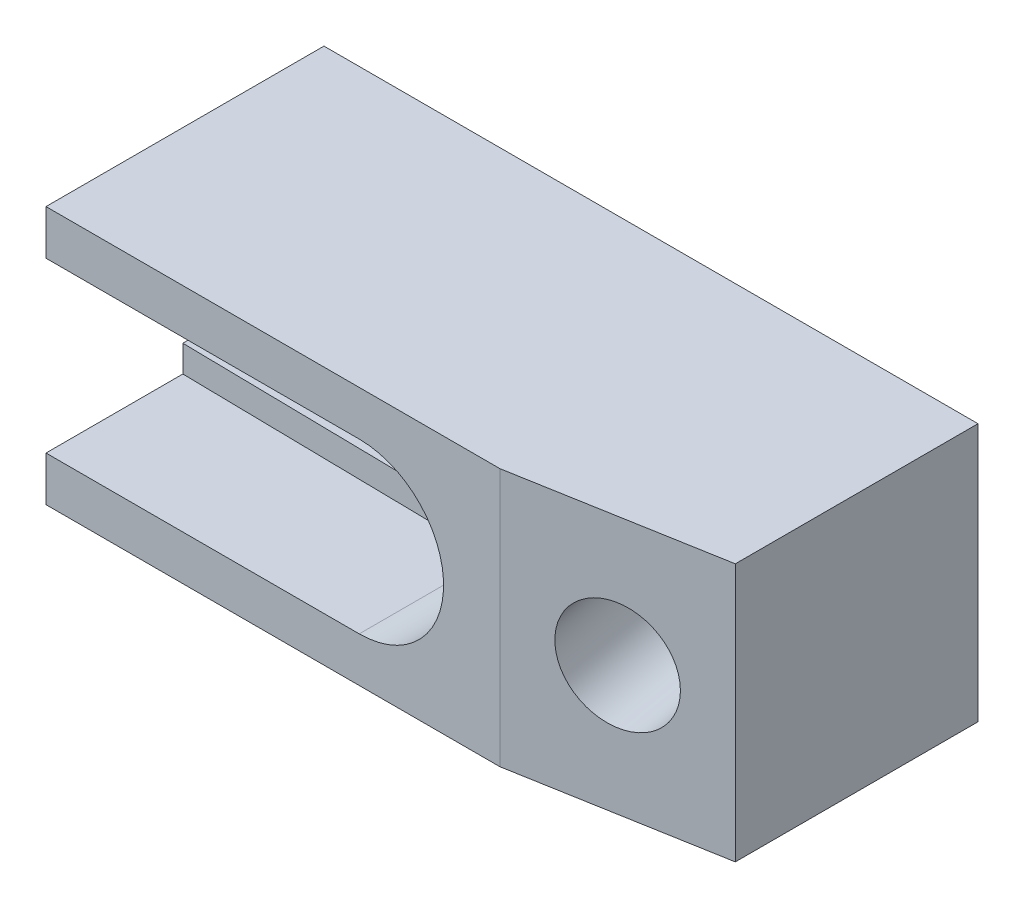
ISO-10303-21;
HEADER;
FILE_DESCRIPTION(('STEP AP214'),'2;1');
FILE_NAME('part.step','',(''),(''),'','','');
FILE_SCHEMA(('AUTOMOTIVE_DESIGN { 1 0 10303 214 1 1 1 1 }'));
ENDSEC;
DATA;
#1=APPLICATION_CONTEXT('core data for automotive mechanical design processes');
#2=APPLICATION_PROTOCOL_DEFINITION('international standard','automotive_design',2000,#1);
#3=PRODUCT_CONTEXT('',#1,'mechanical');
#4=PRODUCT('Part','Part','',(#3));
#5=PRODUCT_RELATED_PRODUCT_CATEGORY('part','',(#4));
#6=PRODUCT_DEFINITION_FORMATION('','',#4);
#7=PRODUCT_DEFINITION_CONTEXT('part definition',#1,'design');
#8=PRODUCT_DEFINITION('design','',#6,#7);
#9=PRODUCT_DEFINITION_SHAPE('','',#8);
#10=(LENGTH_UNIT() NAMED_UNIT(*) SI_UNIT(.MILLI.,.METRE.));
#11=(NAMED_UNIT(*) PLANE_ANGLE_UNIT() SI_UNIT($,.RADIAN.));
#12=(NAMED_UNIT(*) SI_UNIT($,.STERADIAN.) SOLID_ANGLE_UNIT());
#13=UNCERTAINTY_MEASURE_WITH_UNIT(LENGTH_MEASURE(1.E-05),#10,'distance_accuracy_value','');
#14=(GEOMETRIC_REPRESENTATION_CONTEXT(3) GLOBAL_UNCERTAINTY_ASSIGNED_CONTEXT((#13)) GLOBAL_UNIT_ASSIGNED_CONTEXT((#10,
#11,#12)) REPRESENTATION_CONTEXT('',''));
#15=CARTESIAN_POINT('',(0.,0.,0.));
#16=DIRECTION('',(0.,0.,1.));
#17=DIRECTION('',(1.,0.,0.));
#18=AXIS2_PLACEMENT_3D('',#15,#16,#17);
#19=CARTESIAN_POINT('',(50.292,19.05,0.));
#20=DIRECTION('',(0.,0.,1.));
#21=DIRECTION('',(1.,0.,0.));
#22=AXIS2_PLACEMENT_3D('',#19,#20,#21);
#23=PLANE('',#22);
#24=CARTESIAN_POINT('',(28.7527760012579,0.,0.));
#25=DIRECTION('',(0.,0.,1.));
#26=DIRECTION('',(1.,0.,0.));
#27=AXIS2_PLACEMENT_3D('',#24,#25,#26);
#28=ELLIPSE('',#27,8.12341289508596,8.);
#29=CARTESIAN_POINT('',(36.8761888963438,0.,0.));
#30=VERTEX_POINT('',#29);
#31=EDGE_CURVE('E129',#30,#30,#28,.T.);
#32=ORIENTED_EDGE('',*,*,#31,.T.);
#33=EDGE_LOOP('',(#32));
#34=FACE_BOUND('',#33,.T.);
#35=DIRECTION('',(1.,0.,0.));
#36=VECTOR('',#35,1.);
#37=CARTESIAN_POINT('',(50.292,8.509,0.));
#38=LINE('',#37,#36);
#39=CARTESIAN_POINT('',(-46.228,8.509,0.));
#40=VERTEX_POINT('',#39);
#41=CARTESIAN_POINT('',(0.,8.509,0.));
#42=VERTEX_POINT('',#41);
#43=EDGE_CURVE('E124',#40,#42,#38,.T.);
#44=ORIENTED_EDGE('',*,*,#43,.F.);
#45=DIRECTION('',(0.,-1.,0.));
#46=VECTOR('',#45,1.);
#47=CARTESIAN_POINT('',(-46.228,19.05,0.));
#48=LINE('',#47,#46);
#49=CARTESIAN_POINT('',(-46.228,19.05,0.));
#50=VERTEX_POINT('',#49);
#51=EDGE_CURVE('E192',#50,#40,#48,.T.);
#52=ORIENTED_EDGE('',*,*,#51,.F.);
#53=DIRECTION('',(-1.,0.,0.));
#54=VECTOR('',#53,1.);
#55=CARTESIAN_POINT('',(50.292,19.05,0.));
#56=LINE('',#55,#54);
#57=CARTESIAN_POINT('',(50.292,19.05,0.));
#58=VERTEX_POINT('',#57);
#59=EDGE_CURVE('E173',#58,#50,#56,.T.);
#60=ORIENTED_EDGE('',*,*,#59,.F.);
#61=DIRECTION('',(0.,-1.,0.));
#62=VECTOR('',#61,1.);
#63=CARTESIAN_POINT('',(50.292,19.05,0.));
#64=LINE('',#63,#62);
#65=CARTESIAN_POINT('',(50.292,-19.05,0.));
#66=VERTEX_POINT('',#65);
#67=EDGE_CURVE('E194',#58,#66,#64,.T.);
#68=ORIENTED_EDGE('',*,*,#67,.T.);
#69=DIRECTION('',(-1.,0.,0.));
#70=VECTOR('',#69,1.);
#71=CARTESIAN_POINT('',(50.292,-19.05,0.));
#72=LINE('',#71,#70);
#73=CARTESIAN_POINT('',(-46.228,-19.05,0.));
#74=VERTEX_POINT('',#73);
#75=EDGE_CURVE('E162',#66,#74,#72,.T.);
#76=ORIENTED_EDGE('',*,*,#75,.T.);
#77=CARTESIAN_POINT('',(-46.228,-8.509,0.));
#78=VERTEX_POINT('',#77);
#79=EDGE_CURVE('E133',#78,#74,#48,.T.);
#80=ORIENTED_EDGE('',*,*,#79,.F.);
#81=DIRECTION('',(-1.,0.,0.));
#82=VECTOR('',#81,1.);
#83=CARTESIAN_POINT('',(50.292,-8.509,0.));
#84=LINE('',#83,#82);
#85=CARTESIAN_POINT('',(0.,-8.509,0.));
#86=VERTEX_POINT('',#85);
#87=EDGE_CURVE('E125',#86,#78,#84,.T.);
#88=ORIENTED_EDGE('',*,*,#87,.F.);
#89=CARTESIAN_POINT('',(0.,0.,0.));
#90=DIRECTION('',(0.,0.,1.));
#91=DIRECTION('',(1.,0.,0.));
#92=AXIS2_PLACEMENT_3D('',#89,#90,#91);
#93=CIRCLE('',#92,8.509);
#94=EDGE_CURVE('E114',#42,#86,#93,.F.);
#95=ORIENTED_EDGE('',*,*,#94,.F.);
#96=EDGE_LOOP('',(#44,#52,#60,#68,#76,#80,#88,#95));
#97=FACE_BOUND('',#96,.T.);
#98=ADVANCED_FACE('F17',(#34,#97),#23,.F.);
#99=CARTESIAN_POINT('',(-46.228,19.05,0.));
#100=DIRECTION('',(1.,0.,0.));
#101=DIRECTION('',(0.,1.,0.));
#102=AXIS2_PLACEMENT_3D('',#99,#100,#101);
#103=PLANE('',#102);
#104=DIRECTION('',(0.,0.,1.));
#105=VECTOR('',#104,1.);
#106=CARTESIAN_POINT('',(-46.228,8.509,-139.47694052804));
#107=LINE('',#106,#105);
#108=CARTESIAN_POINT('',(-46.228,8.509,20.828));
#109=VERTEX_POINT('',#108);
#110=EDGE_CURVE('E134',#40,#109,#107,.T.);
#111=ORIENTED_EDGE('',*,*,#110,.T.);
#112=DIRECTION('',(0.,1.,0.));
#113=VECTOR('',#112,1.);
#114=CARTESIAN_POINT('',(-46.228,-19.05,20.828));
#115=LINE('',#114,#113);
#116=CARTESIAN_POINT('',(-46.228,12.446,20.828));
#117=VERTEX_POINT('',#116);
#118=EDGE_CURVE('E141',#109,#117,#115,.T.);
#119=ORIENTED_EDGE('',*,*,#118,.T.);
#120=DIRECTION('',(0.,0.,1.));
#121=VECTOR('',#120,1.);
#122=CARTESIAN_POINT('',(-46.228,12.446,0.));
#123=LINE('',#122,#121);
#124=CARTESIAN_POINT('',(-46.228,12.446,41.021));
#125=VERTEX_POINT('',#124);
#126=EDGE_CURVE('E157',#117,#125,#123,.T.);
#127=ORIENTED_EDGE('',*,*,#126,.T.);
#128=DIRECTION('',(0.,-1.,0.));
#129=VECTOR('',#128,1.);
#130=CARTESIAN_POINT('',(-46.228,19.05,41.021));
#131=LINE('',#130,#129);
#132=CARTESIAN_POINT('',(-46.228,19.05,41.021));
#133=VERTEX_POINT('',#132);
#134=EDGE_CURVE('E189',#133,#125,#131,.T.);
#135=ORIENTED_EDGE('',*,*,#134,.F.);
#136=DIRECTION('',(0.,0.,1.));
#137=VECTOR('',#136,1.);
#138=CARTESIAN_POINT('',(-46.228,19.05,0.));
#139=LINE('',#138,#137);
#140=EDGE_CURVE('E176',#50,#133,#139,.T.);
#141=ORIENTED_EDGE('',*,*,#140,.F.);
#142=ORIENTED_EDGE('',*,*,#51,.T.);
#143=EDGE_LOOP('',(#111,#119,#127,#135,#141,#142));
#144=FACE_BOUND('',#143,.T.);
#145=ADVANCED_FACE('F264',(#144),#103,.F.);
#146=DIRECTION('',(0.,0.,1.));
#147=VECTOR('',#146,1.);
#148=CARTESIAN_POINT('',(-46.228,-8.509,-139.47694052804));
#149=LINE('',#148,#147);
#150=CARTESIAN_POINT('',(-46.228,-8.509,20.828));
#151=VERTEX_POINT('',#150);
#152=EDGE_CURVE('E32',#78,#151,#149,.T.);
#153=ORIENTED_EDGE('',*,*,#152,.F.);
#154=ORIENTED_EDGE('',*,*,#79,.T.);
#155=DIRECTION('',(0.,0.,1.));
#156=VECTOR('',#155,1.);
#157=CARTESIAN_POINT('',(-46.228,-19.05,0.));
#158=LINE('',#157,#156);
#159=CARTESIAN_POINT('',(-46.228,-19.05,41.021));
#160=VERTEX_POINT('',#159);
#161=EDGE_CURVE('E164',#74,#160,#158,.T.);
#162=ORIENTED_EDGE('',*,*,#161,.T.);
#163=CARTESIAN_POINT('',(-46.228,-12.446,41.021));
#164=VERTEX_POINT('',#163);
#165=EDGE_CURVE('E188',#164,#160,#131,.T.);
#166=ORIENTED_EDGE('',*,*,#165,.F.);
#167=DIRECTION('',(0.,0.,-1.));
#168=VECTOR('',#167,1.);
#169=CARTESIAN_POINT('',(-46.228,-12.446,0.));
#170=LINE('',#169,#168);
#171=CARTESIAN_POINT('',(-46.228,-12.446,20.828));
#172=VERTEX_POINT('',#171);
#173=EDGE_CURVE('E154',#164,#172,#170,.T.);
#174=ORIENTED_EDGE('',*,*,#173,.T.);
#175=EDGE_CURVE('E39',#172,#151,#115,.T.);
#176=ORIENTED_EDGE('',*,*,#175,.T.);
#177=EDGE_LOOP('',(#153,#154,#162,#166,#174,#176));
#178=FACE_BOUND('',#177,.T.);
#179=ADVANCED_FACE('F251',(#178),#103,.F.);
#180=CARTESIAN_POINT('',(-46.228,-19.05,20.828));
#181=DIRECTION('',(-0.0164812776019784,0.,0.999864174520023));
#182=DIRECTION('',(0.999864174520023,0.,0.0164812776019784));
#183=AXIS2_PLACEMENT_3D('',#180,#181,#182);
#184=PLANE('',#183);
#185=ORIENTED_EDGE('',*,*,#118,.F.);
#186=DIRECTION('',(0.999864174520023,0.,0.0164812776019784));
#187=VECTOR('',#186,1.);
#188=CARTESIAN_POINT('',(-46.228,8.509,20.828));
#189=LINE('',#188,#187);
#190=CARTESIAN_POINT('',(0.,8.509,21.59));
#191=VERTEX_POINT('',#190);
#192=EDGE_CURVE('E10',#109,#191,#189,.T.);
#193=ORIENTED_EDGE('',*,*,#192,.T.);
#194=CARTESIAN_POINT('',(0.,0.,21.59));
#195=DIRECTION('',(-0.0164812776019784,0.,0.999864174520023));
#196=DIRECTION('',(0.999864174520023,0.,0.0164812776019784));
#197=AXIS2_PLACEMENT_3D('',#194,#195,#196);
#198=ELLIPSE('',#197,8.51015589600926,8.509);
#199=CARTESIAN_POINT('',(0.,-8.509,21.59));
#200=VERTEX_POINT('',#199);
#201=EDGE_CURVE('E25',#191,#200,#198,.F.);
#202=ORIENTED_EDGE('',*,*,#201,.T.);
#203=DIRECTION('',(-0.999864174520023,0.,-0.0164812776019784));
#204=VECTOR('',#203,1.);
#205=CARTESIAN_POINT('',(-46.228,-8.509,20.828));
#206=LINE('',#205,#204);
#207=EDGE_CURVE('E128',#200,#151,#206,.T.);
#208=ORIENTED_EDGE('',*,*,#207,.T.);
#209=ORIENTED_EDGE('',*,*,#175,.F.);
#210=DIRECTION('',(-0.999864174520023,0.,-0.0164812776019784));
#211=VECTOR('',#210,1.);
#212=CARTESIAN_POINT('',(3.4636334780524,-12.446,21.6470928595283));
#213=LINE('',#212,#211);
#214=CARTESIAN_POINT('',(0.,-12.446,21.59));
#215=VERTEX_POINT('',#214);
#216=EDGE_CURVE('E207',#215,#172,#213,.T.);
#217=ORIENTED_EDGE('',*,*,#216,.F.);
#218=CARTESIAN_POINT('',(0.,0.,21.59));
#219=DIRECTION('',(-0.0164812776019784,0.,0.999864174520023));
#220=DIRECTION('',(-0.999864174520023,0.,-0.0164812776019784));
#221=AXIS2_PLACEMENT_3D('',#218,#219,#220);
#222=ELLIPSE('',#221,12.4476907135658,12.446);
#223=CARTESIAN_POINT('',(0.,12.446,21.59));
#224=VERTEX_POINT('',#223);
#225=EDGE_CURVE('E143',#224,#215,#222,.F.);
#226=ORIENTED_EDGE('',*,*,#225,.F.);
#227=DIRECTION('',(0.999864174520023,0.,0.0164812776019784));
#228=VECTOR('',#227,1.);
#229=CARTESIAN_POINT('',(-49.9269881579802,12.446,20.7670276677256));
#230=LINE('',#229,#228);
#231=EDGE_CURVE('E145',#117,#224,#230,.T.);
#232=ORIENTED_EDGE('',*,*,#231,.F.);
#233=EDGE_LOOP('',(#185,#193,#202,#208,#209,#217,#226,#232));
#234=FACE_BOUND('',#233,.T.);
#235=ADVANCED_FACE('F210',(#234),#184,.T.);
#236=CARTESIAN_POINT('',(50.292,19.05,0.));
#237=DIRECTION('',(-1.,0.,0.));
#238=DIRECTION('',(0.,-1.,0.));
#239=AXIS2_PLACEMENT_3D('',#236,#237,#238);
#240=PLANE('',#239);
#241=DIRECTION('',(0.,0.,-1.));
#242=VECTOR('',#241,1.);
#243=CARTESIAN_POINT('',(50.292,-19.05,0.));
#244=LINE('',#243,#242);
#245=CARTESIAN_POINT('',(50.292,-19.05,35.814));
#246=VERTEX_POINT('',#245);
#247=EDGE_CURVE('E159',#246,#66,#244,.T.);
#248=ORIENTED_EDGE('',*,*,#247,.T.);
#249=ORIENTED_EDGE('',*,*,#67,.F.);
#250=DIRECTION('',(0.,0.,-1.));
#251=VECTOR('',#250,1.);
#252=CARTESIAN_POINT('',(50.292,19.05,0.));
#253=LINE('',#252,#251);
#254=CARTESIAN_POINT('',(50.292,19.05,35.814));
#255=VERTEX_POINT('',#254);
#256=EDGE_CURVE('E170',#255,#58,#253,.T.);
#257=ORIENTED_EDGE('',*,*,#256,.F.);
#258=DIRECTION('',(0.,-1.,0.));
#259=VECTOR('',#258,1.);
#260=CARTESIAN_POINT('',(50.292,19.05,35.814));
#261=LINE('',#260,#259);
#262=EDGE_CURVE('E182',#255,#246,#261,.T.);
#263=ORIENTED_EDGE('',*,*,#262,.T.);
#264=EDGE_LOOP('',(#248,#249,#257,#263));
#265=FACE_BOUND('',#264,.T.);
#266=ADVANCED_FACE('F19',(#265),#240,.F.);
#267=CARTESIAN_POINT('',(20.7616355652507,19.05,41.021));
#268=DIRECTION('',(0.,0.,-1.));
#269=DIRECTION('',(-1.,0.,0.));
#270=AXIS2_PLACEMENT_3D('',#267,#268,#269);
#271=PLANE('',#270);
#272=ORIENTED_EDGE('',*,*,#134,.T.);
#273=DIRECTION('',(1.,0.,0.));
#274=VECTOR('',#273,1.);
#275=CARTESIAN_POINT('',(20.7616355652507,12.446,41.021));
#276=LINE('',#275,#274);
#277=CARTESIAN_POINT('',(0.,12.446,41.021));
#278=VERTEX_POINT('',#277);
#279=EDGE_CURVE('E204',#125,#278,#276,.T.);
#280=ORIENTED_EDGE('',*,*,#279,.T.);
#281=CARTESIAN_POINT('',(0.,0.,41.021));
#282=DIRECTION('',(0.,0.,-1.));
#283=DIRECTION('',(-1.,0.,0.));
#284=AXIS2_PLACEMENT_3D('',#281,#282,#283);
#285=CIRCLE('',#284,12.446);
#286=CARTESIAN_POINT('',(0.,-12.446,41.021));
#287=VERTEX_POINT('',#286);
#288=EDGE_CURVE('E201',#278,#287,#285,.T.);
#289=ORIENTED_EDGE('',*,*,#288,.T.);
#290=DIRECTION('',(-1.,0.,0.));
#291=VECTOR('',#290,1.);
#292=CARTESIAN_POINT('',(20.7616355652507,-12.446,41.021));
#293=LINE('',#292,#291);
#294=EDGE_CURVE('E198',#287,#164,#293,.T.);
#295=ORIENTED_EDGE('',*,*,#294,.T.);
#296=ORIENTED_EDGE('',*,*,#165,.T.);
#297=DIRECTION('',(1.,0.,0.));
#298=VECTOR('',#297,1.);
#299=CARTESIAN_POINT('',(20.7616355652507,-19.05,41.021));
#300=LINE('',#299,#298);
#301=CARTESIAN_POINT('',(20.7616355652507,-19.05,41.021));
#302=VERTEX_POINT('',#301);
#303=EDGE_CURVE('E166',#160,#302,#300,.T.);
#304=ORIENTED_EDGE('',*,*,#303,.T.);
#305=DIRECTION('',(0.,-1.,0.));
#306=VECTOR('',#305,1.);
#307=CARTESIAN_POINT('',(20.7616355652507,19.05,41.021));
#308=LINE('',#307,#306);
#309=CARTESIAN_POINT('',(20.7616355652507,19.05,41.021));
#310=VERTEX_POINT('',#309);
#311=EDGE_CURVE('E185',#310,#302,#308,.T.);
#312=ORIENTED_EDGE('',*,*,#311,.F.);
#313=DIRECTION('',(1.,0.,0.));
#314=VECTOR('',#313,1.);
#315=CARTESIAN_POINT('',(20.7616355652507,19.05,41.021));
#316=LINE('',#315,#314);
#317=EDGE_CURVE('E178',#133,#310,#316,.T.);
#318=ORIENTED_EDGE('',*,*,#317,.F.);
#319=EDGE_LOOP('',(#272,#280,#289,#295,#296,#304,#312,#318));
#320=FACE_BOUND('',#319,.T.);
#321=ADVANCED_FACE('F228',(#320),#271,.F.);
#322=CARTESIAN_POINT('',(50.292,19.05,35.814));
#323=DIRECTION('',(-0.173648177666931,0.,-0.984807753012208));
#324=DIRECTION('',(-0.984807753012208,0.,0.173648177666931));
#325=AXIS2_PLACEMENT_3D('',#322,#323,#324);
#326=PLANE('',#325);
#327=CARTESIAN_POINT('',(35.5268177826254,0.,38.4175));
#328=DIRECTION('',(0.173648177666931,0.,0.984807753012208));
#329=DIRECTION('',(0.984807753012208,0.,-0.173648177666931));
#330=AXIS2_PLACEMENT_3D('',#327,#328,#329);
#331=CIRCLE('',#330,8.);
#332=CARTESIAN_POINT('',(43.405279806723,0.,37.0283145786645));
#333=VERTEX_POINT('',#332);
#334=EDGE_CURVE('E217',#333,#333,#331,.T.);
#335=ORIENTED_EDGE('',*,*,#334,.F.);
#336=EDGE_LOOP('',(#335));
#337=FACE_BOUND('',#336,.T.);
#338=DIRECTION('',(0.984807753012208,0.,-0.173648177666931));
#339=VECTOR('',#338,1.);
#340=CARTESIAN_POINT('',(50.292,-19.05,35.814));
#341=LINE('',#340,#339);
#342=EDGE_CURVE('E168',#302,#246,#341,.T.);
#343=ORIENTED_EDGE('',*,*,#342,.T.);
#344=ORIENTED_EDGE('',*,*,#262,.F.);
#345=DIRECTION('',(0.984807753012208,0.,-0.173648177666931));
#346=VECTOR('',#345,1.);
#347=CARTESIAN_POINT('',(50.292,19.05,35.814));
#348=LINE('',#347,#346);
#349=EDGE_CURVE('E180',#310,#255,#348,.T.);
#350=ORIENTED_EDGE('',*,*,#349,.F.);
#351=ORIENTED_EDGE('',*,*,#311,.T.);
#352=EDGE_LOOP('',(#343,#344,#350,#351));
#353=FACE_BOUND('',#352,.T.);
#354=ADVANCED_FACE('F224',(#337,#353),#326,.F.);
#355=CARTESIAN_POINT('',(50.292,19.05,41.021));
#356=DIRECTION('',(0.,-1.,0.));
#357=DIRECTION('',(1.,0.,0.));
#358=AXIS2_PLACEMENT_3D('',#355,#356,#357);
#359=PLANE('',#358);
#360=ORIENTED_EDGE('',*,*,#59,.T.);
#361=ORIENTED_EDGE('',*,*,#140,.T.);
#362=ORIENTED_EDGE('',*,*,#317,.T.);
#363=ORIENTED_EDGE('',*,*,#349,.T.);
#364=ORIENTED_EDGE('',*,*,#256,.T.);
#365=EDGE_LOOP('',(#360,#361,#362,#363,#364));
#366=FACE_BOUND('',#365,.T.);
#367=ADVANCED_FACE('F227',(#366),#359,.F.);
#368=CARTESIAN_POINT('',(50.292,-19.05,41.021));
#369=DIRECTION('',(0.,-1.,0.));
#370=DIRECTION('',(1.,0.,0.));
#371=AXIS2_PLACEMENT_3D('',#368,#369,#370);
#372=PLANE('',#371);
#373=ORIENTED_EDGE('',*,*,#161,.F.);
#374=ORIENTED_EDGE('',*,*,#75,.F.);
#375=ORIENTED_EDGE('',*,*,#247,.F.);
#376=ORIENTED_EDGE('',*,*,#342,.F.);
#377=ORIENTED_EDGE('',*,*,#303,.F.);
#378=EDGE_LOOP('',(#373,#374,#375,#376,#377));
#379=FACE_BOUND('',#378,.T.);
#380=ADVANCED_FACE('F241',(#379),#372,.T.);
#381=CARTESIAN_POINT('',(-53.4051282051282,12.446,231.77419052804));
#382=DIRECTION('',(0.,1.,0.));
#383=DIRECTION('',(-1.,0.,0.));
#384=AXIS2_PLACEMENT_3D('',#381,#382,#383);
#385=PLANE('',#384);
#386=ORIENTED_EDGE('',*,*,#126,.F.);
#387=ORIENTED_EDGE('',*,*,#231,.T.);
#388=DIRECTION('',(0.,0.,-1.));
#389=VECTOR('',#388,1.);
#390=CARTESIAN_POINT('',(0.,12.446,231.77419052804));
#391=LINE('',#390,#389);
#392=EDGE_CURVE('E151',#278,#224,#391,.T.);
#393=ORIENTED_EDGE('',*,*,#392,.F.);
#394=ORIENTED_EDGE('',*,*,#279,.F.);
#395=EDGE_LOOP('',(#386,#387,#393,#394));
#396=FACE_BOUND('',#395,.T.);
#397=ADVANCED_FACE('F260',(#396),#385,.F.);
#398=CARTESIAN_POINT('',(0.,0.,231.77419052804));
#399=DIRECTION('',(0.,0.,-1.));
#400=DIRECTION('',(-1.,0.,0.));
#401=AXIS2_PLACEMENT_3D('',#398,#399,#400);
#402=CYLINDRICAL_SURFACE('',#401,12.446);
#403=ORIENTED_EDGE('',*,*,#225,.T.);
#404=DIRECTION('',(0.,0.,-1.));
#405=VECTOR('',#404,1.);
#406=CARTESIAN_POINT('',(0.,-12.446,231.77419052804));
#407=LINE('',#406,#405);
#408=EDGE_CURVE('E148',#287,#215,#407,.T.);
#409=ORIENTED_EDGE('',*,*,#408,.F.);
#410=ORIENTED_EDGE('',*,*,#288,.F.);
#411=ORIENTED_EDGE('',*,*,#392,.T.);
#412=EDGE_LOOP('',(#403,#409,#410,#411));
#413=FACE_BOUND('',#412,.T.);
#414=ADVANCED_FACE('F262',(#413),#402,.F.);
#415=CARTESIAN_POINT('',(0.,-12.446,231.77419052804));
#416=DIRECTION('',(0.,-1.,0.));
#417=DIRECTION('',(1.,0.,0.));
#418=AXIS2_PLACEMENT_3D('',#415,#416,#417);
#419=PLANE('',#418);
#420=ORIENTED_EDGE('',*,*,#408,.T.);
#421=ORIENTED_EDGE('',*,*,#216,.T.);
#422=ORIENTED_EDGE('',*,*,#173,.F.);
#423=ORIENTED_EDGE('',*,*,#294,.F.);
#424=EDGE_LOOP('',(#420,#421,#422,#423));
#425=FACE_BOUND('',#424,.T.);
#426=ADVANCED_FACE('F253',(#425),#419,.F.);
#427=CARTESIAN_POINT('',(-46.228,8.509,-139.47694052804));
#428=DIRECTION('',(0.,-1.,0.));
#429=DIRECTION('',(1.,0.,0.));
#430=AXIS2_PLACEMENT_3D('',#427,#428,#429);
#431=PLANE('',#430);
#432=ORIENTED_EDGE('',*,*,#110,.F.);
#433=ORIENTED_EDGE('',*,*,#43,.T.);
#434=DIRECTION('',(0.,0.,1.));
#435=VECTOR('',#434,1.);
#436=CARTESIAN_POINT('',(0.,8.509,-139.47694052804));
#437=LINE('',#436,#435);
#438=EDGE_CURVE('E120',#42,#191,#437,.T.);
#439=ORIENTED_EDGE('',*,*,#438,.T.);
#440=ORIENTED_EDGE('',*,*,#192,.F.);
#441=EDGE_LOOP('',(#432,#433,#439,#440));
#442=FACE_BOUND('',#441,.T.);
#443=ADVANCED_FACE('F212',(#442),#431,.T.);
#444=CARTESIAN_POINT('',(0.,0.,-139.47694052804));
#445=DIRECTION('',(0.,0.,1.));
#446=DIRECTION('',(1.,0.,0.));
#447=AXIS2_PLACEMENT_3D('',#444,#445,#446);
#448=CYLINDRICAL_SURFACE('',#447,8.509);
#449=ORIENTED_EDGE('',*,*,#438,.F.);
#450=ORIENTED_EDGE('',*,*,#94,.T.);
#451=DIRECTION('',(0.,0.,1.));
#452=VECTOR('',#451,1.);
#453=CARTESIAN_POINT('',(0.,-8.509,-139.47694052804));
#454=LINE('',#453,#452);
#455=EDGE_CURVE('E117',#86,#200,#454,.T.);
#456=ORIENTED_EDGE('',*,*,#455,.T.);
#457=ORIENTED_EDGE('',*,*,#201,.F.);
#458=EDGE_LOOP('',(#449,#450,#456,#457));
#459=FACE_BOUND('',#458,.T.);
#460=ADVANCED_FACE('F116',(#459),#448,.F.);
#461=CARTESIAN_POINT('',(0.,-8.509,-139.47694052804));
#462=DIRECTION('',(0.,1.,0.));
#463=DIRECTION('',(-1.,0.,0.));
#464=AXIS2_PLACEMENT_3D('',#461,#462,#463);
#465=PLANE('',#464);
#466=ORIENTED_EDGE('',*,*,#455,.F.);
#467=ORIENTED_EDGE('',*,*,#87,.T.);
#468=ORIENTED_EDGE('',*,*,#152,.T.);
#469=ORIENTED_EDGE('',*,*,#207,.F.);
#470=EDGE_LOOP('',(#466,#467,#468,#469));
#471=FACE_BOUND('',#470,.T.);
#472=ADVANCED_FACE('F127',(#471),#465,.T.);
#473=CARTESIAN_POINT('',(26.8444088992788,0.,-10.8228876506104));
#474=DIRECTION('',(0.173648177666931,0.,0.984807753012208));
#475=DIRECTION('',(0.984807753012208,0.,-0.173648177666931));
#476=AXIS2_PLACEMENT_3D('',#473,#474,#475);
#477=CYLINDRICAL_SURFACE('',#476,8.);
#478=ORIENTED_EDGE('',*,*,#334,.T.);
#479=EDGE_LOOP('',(#478));
#480=FACE_BOUND('',#479,.T.);
#481=ORIENTED_EDGE('',*,*,#31,.F.);
#482=EDGE_LOOP('',(#481));
#483=FACE_BOUND('',#482,.T.);
#484=ADVANCED_FACE('F221',(#480,#483),#477,.F.);
#485=CLOSED_SHELL('',(#98,#145,#179,#235,#266,#321,#354,#367,#380,#397,#414,#426,#443,#460,#472,#484));
#486=MANIFOLD_SOLID_BREP('B1',#485);
#487=ADVANCED_BREP_SHAPE_REPRESENTATION('',(#18,#486),#14);
#488=SHAPE_DEFINITION_REPRESENTATION(#9,#487);
ENDSEC;
END-ISO-10303-21;
